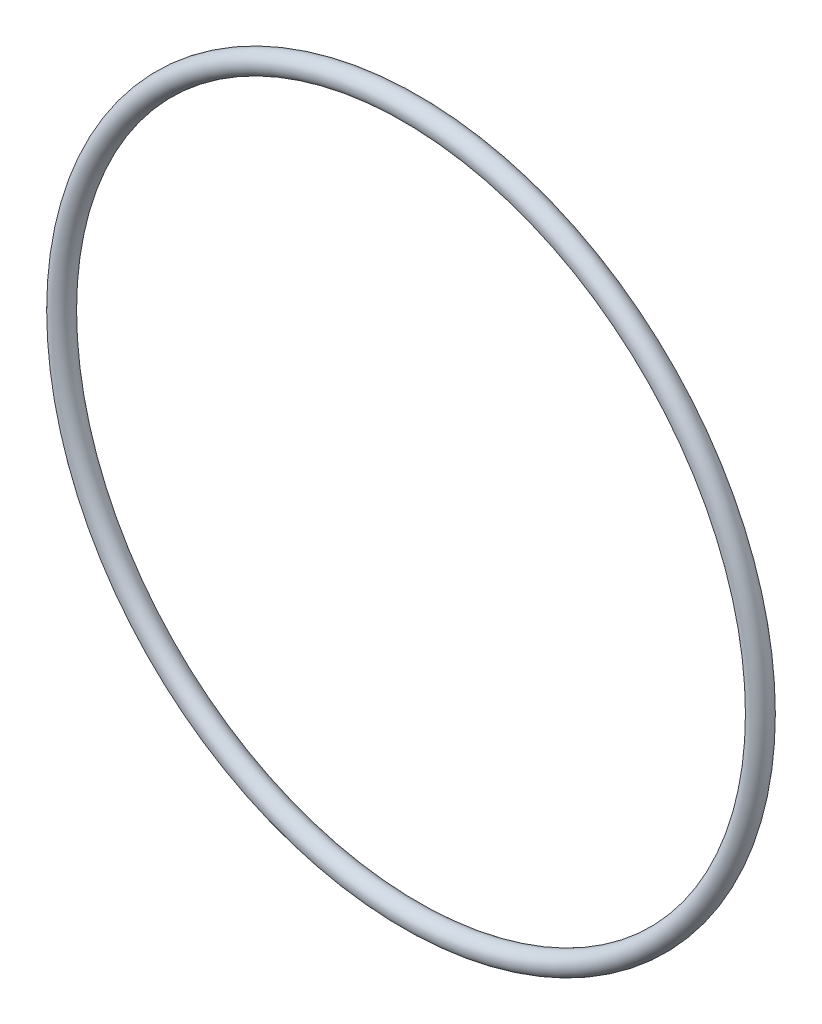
from build123d import *

# Parameters (mm, degrees)
SKETCH1_R = 0.889


with BuildPart() as part:
    # Sketch1 → Base-Revolve (revolve)
    with BuildSketch(Plane(origin=(0, 0, 0), x_dir=(0, 0, -1), z_dir=(1, 0, 0)), mode=Mode.PRIVATE) as base_revolve_sk:
        with Locations((0, 29.337)):
            Circle(SKETCH1_R)
    revolve(base_revolve_sk.sketch.rotate(Axis((0, 0, 58.42), (0, 0, -1)), 90), axis=Axis((0, 0, 58.42), (0, 0, -1)))


solid = part.part
